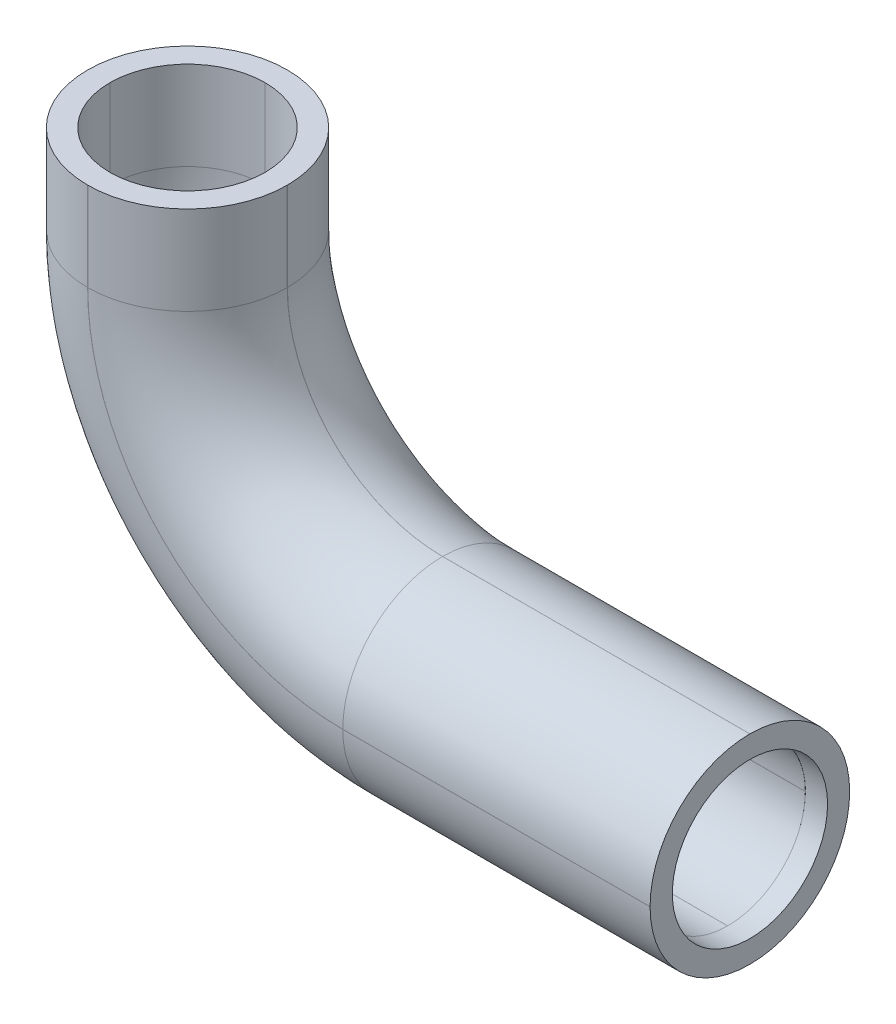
from build123d import *

# Parameters (mm, degrees)
BOSS_EXTRUDE1_DEPTH = 28.575
FILLET4_R           = 22.225
FILLET5_R           = 50.8
FILLET6_R           = 14.2748
SHELL2_T            = -3.175
SKETCH2_R           = 11.1125
CUT_EXTRUDE1_DEPTH  = 3.175


with BuildPart() as part:
    # Sketch1 → Boss-Extrude1 (new body)
    with BuildSketch(Plane.XY):
        Polygon((0, 0), (94.7928, 0), (94.7928, 28.575), (28.575, 28.575), (28.575, 63.5), (0, 63.5), align=None)
    extrude(amount=-BOSS_EXTRUDE1_DEPTH)

    # Fillet4
    fillet4_edges = [part.edges().sort_by_distance(p)[0] for p in [
        (28.575, 28.575, -14.2875),
    ]]
    fillet(fillet4_edges, radius=FILLET4_R)

    # Fillet5
    fillet5_edges = [part.edges().sort_by_distance(p)[0] for p in [
        (0, 0, -14.2875),
    ]]
    fillet(fillet5_edges, radius=FILLET5_R)

    # Fillet6
    fillet6_edges = [part.edges().sort_by_distance(p)[0] for p in [
        (72.7964, 28.575, -28.575),
        (28.575, 57.15, 0),
        (28.575, 57.15, -28.575),
        (35.084551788, 35.084551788, 0),
        (35.084551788, 35.084551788, -28.575),
        (72.7964, 0, 0),
        (14.878975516, 14.878975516, 0),
        (72.7964, 0, -28.575),
        (14.878975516, 14.878975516, -28.575),
        (0, 57.15, -28.575),
        (72.7964, 28.575, 0),
        (0, 57.15, 0),
    ]]
    fillet(fillet6_edges, radius=FILLET6_R)

    # Shell2
    shell2_openings = [part.faces().sort_by_distance(p)[0] for p in [
        (14.2875, 63.5, -14.2875),
    ]]
    offset(amount=SHELL2_T, openings=shell2_openings, kind=Kind.INTERSECTION)

    # Sketch2 → Cut-Extrude1 (cut)
    with BuildSketch(Plane(origin=(94.7928, 0, 0), x_dir=(0, 0, -1), z_dir=(1, 0, 0))):
        with Locations((14.3002, 14.3002)):
            Circle(SKETCH2_R)
    extrude(amount=-CUT_EXTRUDE1_DEPTH, mode=Mode.SUBTRACT)


solid = part.part
